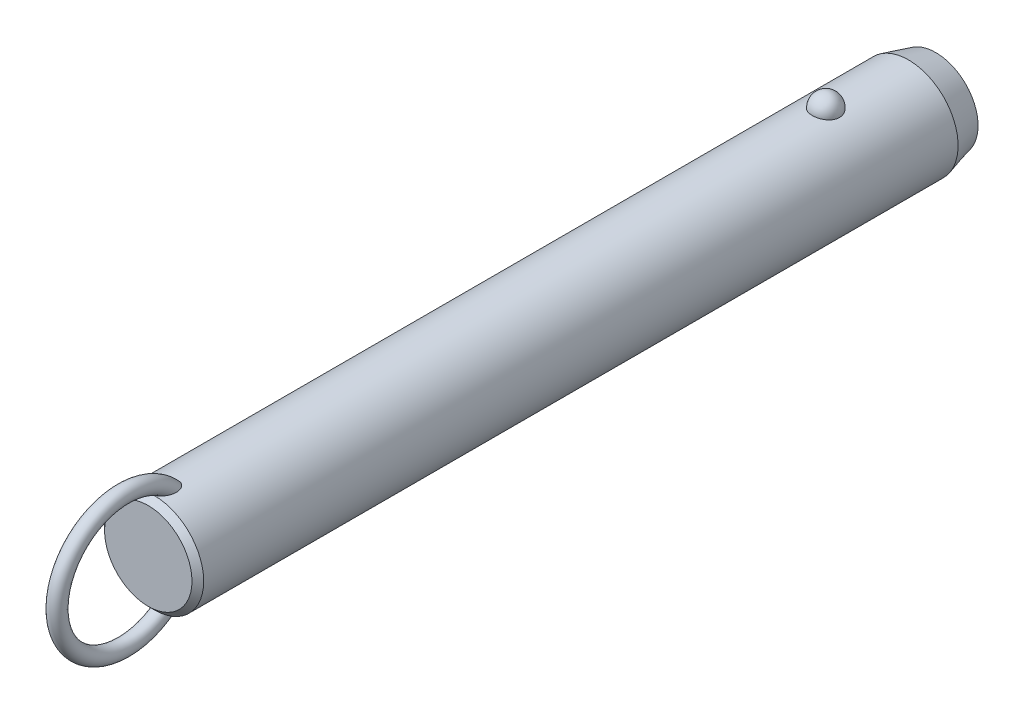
ISO-10303-21;
HEADER;
FILE_DESCRIPTION(('STEP AP214'),'2;1');
FILE_NAME('part.step','',(''),(''),'','','');
FILE_SCHEMA(('AUTOMOTIVE_DESIGN { 1 0 10303 214 1 1 1 1 }'));
ENDSEC;
DATA;
#1=APPLICATION_CONTEXT('core data for automotive mechanical design processes');
#2=APPLICATION_PROTOCOL_DEFINITION('international standard','automotive_design',2000,#1);
#3=PRODUCT_CONTEXT('',#1,'mechanical');
#4=PRODUCT('Part','Part','',(#3));
#5=PRODUCT_RELATED_PRODUCT_CATEGORY('part','',(#4));
#6=PRODUCT_DEFINITION_FORMATION('','',#4);
#7=PRODUCT_DEFINITION_CONTEXT('part definition',#1,'design');
#8=PRODUCT_DEFINITION('design','',#6,#7);
#9=PRODUCT_DEFINITION_SHAPE('','',#8);
#10=(LENGTH_UNIT() NAMED_UNIT(*) SI_UNIT(.MILLI.,.METRE.));
#11=(NAMED_UNIT(*) PLANE_ANGLE_UNIT() SI_UNIT($,.RADIAN.));
#12=(NAMED_UNIT(*) SI_UNIT($,.STERADIAN.) SOLID_ANGLE_UNIT());
#13=UNCERTAINTY_MEASURE_WITH_UNIT(LENGTH_MEASURE(1.E-05),#10,'distance_accuracy_value','');
#14=(GEOMETRIC_REPRESENTATION_CONTEXT(3) GLOBAL_UNCERTAINTY_ASSIGNED_CONTEXT((#13)) GLOBAL_UNIT_ASSIGNED_CONTEXT((#10,
#11,#12)) REPRESENTATION_CONTEXT('',''));
#15=CARTESIAN_POINT('',(0.,0.,0.));
#16=DIRECTION('',(0.,0.,1.));
#17=DIRECTION('',(1.,0.,0.));
#18=AXIS2_PLACEMENT_3D('',#15,#16,#17);
#19=CARTESIAN_POINT('',(0.,0.,157.5));
#20=DIRECTION('',(0.,0.,-1.));
#21=DIRECTION('',(-1.,0.,0.));
#22=AXIS2_PLACEMENT_3D('',#19,#20,#21);
#23=CYLINDRICAL_SURFACE('',#22,12.7);
#24=CARTESIAN_POINT('',(3.46661256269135,12.2177165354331,-3.50000000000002));
#25=CARTESIAN_POINT('',(3.4666090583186,12.2177194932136,-3.30432790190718));
#26=CARTESIAN_POINT('',(3.45063567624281,12.2222841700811,-3.10861112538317));
#27=CARTESIAN_POINT('',(3.38712451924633,12.2400345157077,-2.72271899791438));
#28=CARTESIAN_POINT('',(3.33957415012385,12.2532236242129,-2.53254588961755));
#29=CARTESIAN_POINT('',(3.2141234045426,12.286724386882,-2.16324948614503));
#30=CARTESIAN_POINT('',(3.13623639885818,12.3070329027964,-1.98412136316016));
#31=CARTESIAN_POINT('',(2.95205930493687,12.3525018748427,-1.6418059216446));
#32=CARTESIAN_POINT('',(2.84577003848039,12.3776621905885,-1.47861814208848));
#33=CARTESIAN_POINT('',(2.60688050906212,12.4301712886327,-1.17190583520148));
#34=CARTESIAN_POINT('',(2.47415697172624,12.4575299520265,-1.0284789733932));
#35=CARTESIAN_POINT('',(2.18615174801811,12.5112810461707,-0.766177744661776));
#36=CARTESIAN_POINT('',(2.03087002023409,12.5376734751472,-0.647303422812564));
#37=CARTESIAN_POINT('',(1.70237334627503,12.5864761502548,-0.437732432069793));
#38=CARTESIAN_POINT('',(1.52920948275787,12.6088972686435,-0.346958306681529));
#39=CARTESIAN_POINT('',(1.16944170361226,12.6473352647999,-0.195750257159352));
#40=CARTESIAN_POINT('',(0.982839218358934,12.663352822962,-0.135313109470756));
#41=CARTESIAN_POINT('',(0.604961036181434,12.6869706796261,-0.0473241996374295));
#42=CARTESIAN_POINT('',(0.41382314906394,12.6947125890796,-0.0192185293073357));
#43=CARTESIAN_POINT('',(0.0293827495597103,12.7014203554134,0.00517254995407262));
#44=CARTESIAN_POINT('',(-0.163919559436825,12.7003870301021,0.00146092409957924));
#45=CARTESIAN_POINT('',(-0.544374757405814,12.689735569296,-0.0373939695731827));
#46=CARTESIAN_POINT('',(-0.731575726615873,12.6802364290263,-0.0721015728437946));
#47=CARTESIAN_POINT('',(-1.09733277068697,12.6538333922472,-0.171364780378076));
#48=CARTESIAN_POINT('',(-1.27588869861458,12.6369293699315,-0.235920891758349));
#49=CARTESIAN_POINT('',(-1.6204698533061,12.5973946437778,-0.393548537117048));
#50=CARTESIAN_POINT('',(-1.78641865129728,12.5747321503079,-0.486778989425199));
#51=CARTESIAN_POINT('',(-2.10030671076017,12.5261316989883,-0.699110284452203));
#52=CARTESIAN_POINT('',(-2.24824419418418,12.5001934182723,-0.818213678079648));
#53=CARTESIAN_POINT('',(-2.52491489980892,12.4472906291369,-1.0815712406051));
#54=CARTESIAN_POINT('',(-2.65324222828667,12.4203160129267,-1.22624992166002));
#55=CARTESIAN_POINT('',(-2.88410007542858,12.3687509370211,-1.53528325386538));
#56=CARTESIAN_POINT('',(-2.98662883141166,12.3441606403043,-1.69963924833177));
#57=CARTESIAN_POINT('',(-3.16432417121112,12.2998199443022,-2.04548497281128));
#58=CARTESIAN_POINT('',(-3.23917525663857,12.2801261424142,-2.22714424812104));
#59=CARTESIAN_POINT('',(-3.35800573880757,12.248167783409,-2.60091389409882));
#60=CARTESIAN_POINT('',(-3.4019860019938,12.2359030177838,-2.79302397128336));
#61=CARTESIAN_POINT('',(-3.45784812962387,12.2202347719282,-3.18140279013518));
#62=CARTESIAN_POINT('',(-3.46986123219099,12.2167950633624,-3.37765118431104));
#63=CARTESIAN_POINT('',(-3.46186273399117,12.2190638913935,-3.76943689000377));
#64=CARTESIAN_POINT('',(-3.44185196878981,12.2247721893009,-3.96497421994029));
#65=CARTESIAN_POINT('',(-3.37048652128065,12.2446381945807,-4.34881728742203));
#66=CARTESIAN_POINT('',(-3.31928253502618,12.2587552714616,-4.53715319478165));
#67=CARTESIAN_POINT('',(-3.18693461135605,12.2938237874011,-4.9023172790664));
#68=CARTESIAN_POINT('',(-3.1057895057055,12.3147754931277,-5.07914500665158));
#69=CARTESIAN_POINT('',(-2.91506431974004,12.3613125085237,-5.41732059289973));
#70=CARTESIAN_POINT('',(-2.80533587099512,12.3869217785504,-5.57858147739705));
#71=CARTESIAN_POINT('',(-2.560414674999,12.4398525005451,-5.88013283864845));
#72=CARTESIAN_POINT('',(-2.42522099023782,12.4671740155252,-6.02042254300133));
#73=CARTESIAN_POINT('',(-2.1323357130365,12.5205965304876,-6.27662798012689));
#74=CARTESIAN_POINT('',(-1.97456596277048,12.5466928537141,-6.39245542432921));
#75=CARTESIAN_POINT('',(-1.64115839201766,12.5946384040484,-6.59583547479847));
#76=CARTESIAN_POINT('',(-1.46552179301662,12.6164879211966,-6.68339001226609));
#77=CARTESIAN_POINT('',(-1.10356050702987,12.6532533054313,-6.82682153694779));
#78=CARTESIAN_POINT('',(-0.9173913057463,12.6682500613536,-6.88306988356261));
#79=CARTESIAN_POINT('',(-0.537836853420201,12.6900288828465,-6.96386887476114));
#80=CARTESIAN_POINT('',(-0.344452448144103,12.6968119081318,-6.98842322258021));
#81=CARTESIAN_POINT('',(0.0402577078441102,12.7013667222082,-7.00496469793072));
#82=CARTESIAN_POINT('',(0.231556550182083,12.6993008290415,-6.99753844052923));
#83=CARTESIAN_POINT('',(0.610105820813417,12.6867505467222,-6.95166366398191));
#84=CARTESIAN_POINT('',(0.797356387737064,12.6762664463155,-6.91321620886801));
#85=CARTESIAN_POINT('',(1.16186657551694,12.6480587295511,-6.80658431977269));
#86=CARTESIAN_POINT('',(1.33915951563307,12.6303611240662,-6.73850666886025));
#87=CARTESIAN_POINT('',(1.67968518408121,12.5896027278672,-6.57450875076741));
#88=CARTESIAN_POINT('',(1.84291705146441,12.5665416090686,-6.47858678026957));
#89=CARTESIAN_POINT('',(2.15340192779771,12.5171072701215,-6.25982455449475));
#90=CARTESIAN_POINT('',(2.30037831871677,12.4906895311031,-6.13660186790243));
#91=CARTESIAN_POINT('',(2.5717412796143,12.4376567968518,-5.86739587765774));
#92=CARTESIAN_POINT('',(2.69612388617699,12.4110417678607,-5.72140858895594));
#93=CARTESIAN_POINT('',(2.92107785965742,12.360051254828,-5.40794137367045));
#94=CARTESIAN_POINT('',(3.02121329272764,12.3357209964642,-5.24014110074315));
#95=CARTESIAN_POINT('',(3.19236291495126,12.2925446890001,-4.88969865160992));
#96=CARTESIAN_POINT('',(3.26338839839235,12.2736965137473,-4.70706226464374));
#97=CARTESIAN_POINT('',(3.36788038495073,12.245404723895,-4.35469510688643));
#98=CARTESIAN_POINT('',(3.40484026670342,12.2351018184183,-4.18605935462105));
#99=CARTESIAN_POINT('',(3.45420764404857,12.2212564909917,-3.84496058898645));
#100=CARTESIAN_POINT('',(3.46661565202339,12.2177139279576,-3.67249765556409));
#101=CARTESIAN_POINT('',(3.46661256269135,12.2177165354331,-3.50000000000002));
#102=B_SPLINE_CURVE_WITH_KNOTS('',3,(#24,#25,#26,#27,#28,#29,#30,#31,#32,#33,#34,#35,#36,#37,
#38,#39,#40,#41,#42,#43,#44,#45,#46,#47,#48,#49,#50,#51,#52,#53,#54,#55,#56,#57,#58,#59,#60,#61,
#62,#63,#64,#65,#66,#67,#68,#69,#70,#71,#72,#73,#74,#75,#76,#77,#78,#79,#80,#81,#82,#83,#84,#85,
#86,#87,#88,#89,#90,#91,#92,#93,#94,#95,#96,#97,#98,#99,#100,#101),.UNSPECIFIED.,.T.,.F.,(4,2,2,
2,2,2,2,2,2,2,2,2,2,2,2,2,2,2,2,2,2,2,2,2,2,2,2,2,2,2,2,2,2,2,2,2,2,2,4),(0.,0.586396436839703,
1.17302689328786,1.7593990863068,2.34575431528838,2.93491084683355,3.52406845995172,
4.11158733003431,4.69904375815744,5.2762784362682,5.85345931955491,6.42265312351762,
6.99185659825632,7.56427334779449,8.136746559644,8.71981013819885,9.3029135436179,
9.89247258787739,10.4820150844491,11.0691335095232,11.6562366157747,12.2405256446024,
12.8248374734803,13.412244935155,13.9996740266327,14.5891883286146,15.1786623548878,
15.7609861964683,16.3432419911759,16.9148635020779,17.4864654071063,18.0560241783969,
18.6256177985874,19.2037609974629,19.7820055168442,20.3699810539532,20.957728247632,
21.4746855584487,21.9916320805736),.UNSPECIFIED.);
#103=CARTESIAN_POINT('',(3.46661256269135,12.2177165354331,-3.50000000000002));
#104=VERTEX_POINT('',#103);
#105=EDGE_CURVE('E41',#104,#104,#102,.T.);
#106=ORIENTED_EDGE('',*,*,#105,.T.);
#107=EDGE_LOOP('',(#106));
#108=FACE_BOUND('',#107,.T.);
#109=CARTESIAN_POINT('',(0.,0.,168.7));
#110=DIRECTION('',(0.,0.,1.));
#111=DIRECTION('',(1.,0.,0.));
#112=AXIS2_PLACEMENT_3D('',#109,#110,#111);
#113=CIRCLE('',#112,12.7);
#114=CARTESIAN_POINT('',(12.7,0.,168.7));
#115=VERTEX_POINT('',#114);
#116=EDGE_CURVE('E10',#115,#115,#113,.F.);
#117=ORIENTED_EDGE('',*,*,#116,.T.);
#118=EDGE_LOOP('',(#117));
#119=FACE_BOUND('',#118,.T.);
#120=CARTESIAN_POINT('',(-0.548122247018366,-12.6881662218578,162.443218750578));
#121=CARTESIAN_POINT('',(-0.648865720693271,-12.6838128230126,162.477926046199));
#122=CARTESIAN_POINT('',(-0.746398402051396,-12.6783867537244,162.522042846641));
#123=CARTESIAN_POINT('',(-0.932125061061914,-12.666091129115,162.626764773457));
#124=CARTESIAN_POINT('',(-1.02030388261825,-12.6592192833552,162.687396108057));
#125=CARTESIAN_POINT('',(-1.18487740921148,-12.6448747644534,162.821847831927));
#126=CARTESIAN_POINT('',(-1.26134296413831,-12.637406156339,162.895582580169));
#127=CARTESIAN_POINT('',(-1.4023120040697,-12.6225412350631,163.053604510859));
#128=CARTESIAN_POINT('',(-1.466814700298,-12.6151449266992,163.13789238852));
#129=CARTESIAN_POINT('',(-1.60714786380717,-12.5981718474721,163.349657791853));
#130=CARTESIAN_POINT('',(-1.67725126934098,-12.588900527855,163.480962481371));
#131=CARTESIAN_POINT('',(-1.79536591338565,-12.5725964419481,163.753247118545));
#132=CARTESIAN_POINT('',(-1.84333535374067,-12.5655679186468,163.894244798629));
#133=CARTESIAN_POINT('',(-1.93422576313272,-12.5519624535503,164.237645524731));
#134=CARTESIAN_POINT('',(-1.96788773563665,-12.5466298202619,164.442557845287));
#135=CARTESIAN_POINT('',(-1.9941399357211,-12.542463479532,164.751760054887));
#136=CARTESIAN_POINT('',(-1.99883864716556,-12.5417153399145,164.855298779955));
#137=CARTESIAN_POINT('',(-2.00078003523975,-12.5414074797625,165.06245124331));
#138=CARTESIAN_POINT('',(-1.99802449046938,-12.5418474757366,165.166064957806));
#139=CARTESIAN_POINT('',(-1.98336733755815,-12.5441750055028,165.41032076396));
#140=CARTESIAN_POINT('',(-1.96851430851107,-12.5465291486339,165.550780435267));
#141=CARTESIAN_POINT('',(-1.92707089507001,-12.5529612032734,165.829960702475));
#142=CARTESIAN_POINT('',(-1.900474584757,-12.5570399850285,165.968680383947));
#143=CARTESIAN_POINT('',(-1.83619120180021,-12.5666008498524,166.24341135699));
#144=CARTESIAN_POINT('',(-1.79850828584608,-12.57208240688,166.379423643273));
#145=CARTESIAN_POINT('',(-1.71223796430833,-12.5841228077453,166.647842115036));
#146=CARTESIAN_POINT('',(-1.66365679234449,-12.5906810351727,166.780250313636));
#147=CARTESIAN_POINT('',(-1.57804503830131,-12.6016176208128,166.98548877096));
#148=CARTESIAN_POINT('',(-1.54477252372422,-12.6057501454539,167.059914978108));
#149=CARTESIAN_POINT('',(-1.47424480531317,-12.6141930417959,167.206839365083));
#150=CARTESIAN_POINT('',(-1.43699041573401,-12.6185033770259,167.279337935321));
#151=CARTESIAN_POINT('',(-1.35825795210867,-12.6272207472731,167.421892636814));
#152=CARTESIAN_POINT('',(-1.31678520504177,-12.6316276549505,167.491951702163));
#153=CARTESIAN_POINT('',(-1.22917793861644,-12.6404532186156,167.629070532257));
#154=CARTESIAN_POINT('',(-1.18304514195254,-12.6448718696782,167.696131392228));
#155=CARTESIAN_POINT('',(-1.07246411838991,-12.6547893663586,167.843874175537));
#156=CARTESIAN_POINT('',(-1.0064223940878,-12.6602600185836,167.923384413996));
#157=CARTESIAN_POINT('',(-0.864441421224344,-12.6707460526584,168.073169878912));
#158=CARTESIAN_POINT('',(-0.788516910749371,-12.6757620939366,168.143458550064));
#159=CARTESIAN_POINT('',(-0.652215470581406,-12.6833591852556,168.248680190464));
#160=CARTESIAN_POINT('',(-0.594982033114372,-12.6861973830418,168.287624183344));
#161=CARTESIAN_POINT('',(-0.475269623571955,-12.6912445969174,168.356489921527));
#162=CARTESIAN_POINT('',(-0.412800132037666,-12.6934547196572,168.386427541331));
#163=CARTESIAN_POINT('',(-0.295749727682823,-12.6966636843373,168.42975652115));
#164=CARTESIAN_POINT('',(-0.241949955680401,-12.6978134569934,168.445218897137));
#165=CARTESIAN_POINT('',(-0.132508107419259,-12.6994261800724,168.466884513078));
#166=CARTESIAN_POINT('',(-0.0768679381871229,-12.6998898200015,168.473097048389));
#167=CARTESIAN_POINT('',(0.0347696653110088,-12.7000752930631,168.475583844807));
#168=CARTESIAN_POINT('',(0.0907676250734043,-12.6997954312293,168.471835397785));
#169=CARTESIAN_POINT('',(0.201283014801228,-12.6985255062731,168.454788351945));
#170=CARTESIAN_POINT('',(0.255799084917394,-12.6975348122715,168.441481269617));
#171=CARTESIAN_POINT('',(0.376042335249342,-12.6946091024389,168.40203792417));
#172=CARTESIAN_POINT('',(0.440950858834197,-12.6924943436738,168.373449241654));
#173=CARTESIAN_POINT('',(0.56535027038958,-12.6875639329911,168.306323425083));
#174=CARTESIAN_POINT('',(0.624828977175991,-12.6847467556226,168.267764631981));
#175=CARTESIAN_POINT('',(0.774116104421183,-12.6767252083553,168.156949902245));
#176=CARTESIAN_POINT('',(0.859449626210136,-12.6711344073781,168.078760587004));
#177=CARTESIAN_POINT('',(1.01789440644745,-12.6593922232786,167.910943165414));
#178=CARTESIAN_POINT('',(1.09096902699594,-12.653239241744,167.821282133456));
#179=CARTESIAN_POINT('',(1.22268793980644,-12.6411674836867,167.640265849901));
#180=CARTESIAN_POINT('',(1.28193986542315,-12.6352572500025,167.549345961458));
#181=CARTESIAN_POINT('',(1.39259777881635,-12.6235401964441,167.362792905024));
#182=CARTESIAN_POINT('',(1.44399707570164,-12.6177334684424,167.267155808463));
#183=CARTESIAN_POINT('',(1.53972870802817,-12.6064093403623,167.072273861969));
#184=CARTESIAN_POINT('',(1.58405262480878,-12.6008922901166,166.973024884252));
#185=CARTESIAN_POINT('',(1.66600705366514,-12.5903187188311,166.771772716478));
#186=CARTESIAN_POINT('',(1.70363651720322,-12.5852622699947,166.669769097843));
#187=CARTESIAN_POINT('',(1.77545379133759,-12.5753406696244,166.454358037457));
#188=CARTESIAN_POINT('',(1.80903453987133,-12.5705328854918,166.340745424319));
#189=CARTESIAN_POINT('',(1.86844163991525,-12.5618400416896,166.111457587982));
#190=CARTESIAN_POINT('',(1.89426665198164,-12.5579551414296,165.995782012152));
#191=CARTESIAN_POINT('',(1.93785464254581,-12.5513030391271,165.763007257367));
#192=CARTESIAN_POINT('',(1.95562640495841,-12.5485346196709,165.645909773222));
#193=CARTESIAN_POINT('',(1.98264463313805,-12.5442934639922,165.410747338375));
#194=CARTESIAN_POINT('',(1.99189298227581,-12.5428204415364,165.29268260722));
#195=CARTESIAN_POINT('',(2.00416068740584,-12.540871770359,164.980622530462));
#196=CARTESIAN_POINT('',(1.99944433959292,-12.541631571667,164.786229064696));
#197=CARTESIAN_POINT('',(1.96113755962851,-12.5476846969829,164.400309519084));
#198=CARTESIAN_POINT('',(1.92758341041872,-12.5529723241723,164.208780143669));
#199=CARTESIAN_POINT('',(1.83934342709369,-12.5661532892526,163.882272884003));
#200=CARTESIAN_POINT('',(1.79215440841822,-12.5730485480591,163.74524997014));
#201=CARTESIAN_POINT('',(1.67676242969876,-12.588958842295,163.480445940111));
#202=CARTESIAN_POINT('',(1.60859050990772,-12.597970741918,163.352651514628));
#203=CARTESIAN_POINT('',(1.4658383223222,-12.6152829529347,163.135800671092));
#204=CARTESIAN_POINT('',(1.39525727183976,-12.6233659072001,163.04410500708));
#205=CARTESIAN_POINT('',(1.23992594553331,-12.6395676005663,162.873485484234));
#206=CARTESIAN_POINT('',(1.1551793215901,-12.6476863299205,162.794558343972));
#207=CARTESIAN_POINT('',(0.971995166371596,-12.6630846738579,162.652643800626));
#208=CARTESIAN_POINT('',(0.873456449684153,-12.6703572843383,162.589784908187));
#209=CARTESIAN_POINT('',(0.665847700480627,-12.6829569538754,162.484487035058));
#210=CARTESIAN_POINT('',(0.556784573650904,-12.688285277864,162.442034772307));
#211=CARTESIAN_POINT('',(0.347338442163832,-12.6956226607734,162.384443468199));
#212=CARTESIAN_POINT('',(0.24775974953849,-12.6979816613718,162.366399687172));
#213=CARTESIAN_POINT('',(0.0470218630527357,-12.7003077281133,162.348600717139));
#214=CARTESIAN_POINT('',(-0.0541350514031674,-12.7002779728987,162.348821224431));
#215=CARTESIAN_POINT('',(-0.221414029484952,-12.6982482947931,162.364363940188));
#216=CARTESIAN_POINT('',(-0.288055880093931,-12.6969033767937,162.374666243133));
#217=CARTESIAN_POINT('',(-0.419599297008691,-12.6932369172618,162.40313489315));
#218=CARTESIAN_POINT('',(-0.484501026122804,-12.6909154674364,162.421300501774));
#219=CARTESIAN_POINT('',(-0.548122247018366,-12.6881662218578,162.443218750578));
#220=B_SPLINE_CURVE_WITH_KNOTS('',3,(#120,#121,#122,#123,#124,#125,#126,#127,#128,#129,#130,
#131,#132,#133,#134,#135,#136,#137,#138,#139,#140,#141,#142,#143,#144,#145,#146,#147,#148,#149,
#150,#151,#152,#153,#154,#155,#156,#157,#158,#159,#160,#161,#162,#163,#164,#165,#166,#167,#168,
#169,#170,#171,#172,#173,#174,#175,#176,#177,#178,#179,#180,#181,#182,#183,#184,#185,#186,#187,
#188,#189,#190,#191,#192,#193,#194,#195,#196,#197,#198,#199,#200,#201,#202,#203,#204,#205,#206,
#207,#208,#209,#210,#211,#212,#213,#214,#215,#216,#217,#218,#219),.UNSPECIFIED.,.T.,.F.,(4,2,2,
2,2,2,2,2,2,2,2,2,2,2,2,2,2,2,2,2,2,2,2,2,2,2,2,2,2,2,2,2,2,2,2,2,2,2,2,2,2,2,2,2,2,2,2,2,2,4),
(0.,0.31964225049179,0.639794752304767,0.957927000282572,1.27608021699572,1.72100165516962,
2.16675988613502,2.78630021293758,3.09705782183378,3.40774128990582,3.8309635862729,
4.25439969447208,4.67767724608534,5.1007133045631,5.34550297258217,5.59024267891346,
5.83467707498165,6.07902143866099,6.38891080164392,6.69834321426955,6.90560910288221,
7.11250749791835,7.27977315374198,7.44687060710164,7.61434932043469,7.78197685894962,
7.99365544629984,8.20579780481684,8.55147335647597,8.89816429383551,9.22375138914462,
9.54961437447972,9.87586224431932,10.202161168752,10.557587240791,10.9130746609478,
11.2681734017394,11.6231936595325,12.2046601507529,12.7853961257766,13.219164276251,
13.6522938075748,13.9989174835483,14.3454519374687,14.6946768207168,15.0436740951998,
15.3457513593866,15.6474266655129,15.8493051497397,16.0511646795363),.UNSPECIFIED.);
#221=CARTESIAN_POINT('',(-0.548122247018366,-12.6881662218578,162.443218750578));
#222=VERTEX_POINT('',#221);
#223=EDGE_CURVE('E59',#222,#222,#220,.T.);
#224=ORIENTED_EDGE('',*,*,#223,.T.);
#225=EDGE_LOOP('',(#224));
#226=FACE_BOUND('',#225,.T.);
#227=CARTESIAN_POINT('',(-0.548122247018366,12.6881662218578,162.443218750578));
#228=CARTESIAN_POINT('',(-0.459436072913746,12.6919968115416,162.412673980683));
#229=CARTESIAN_POINT('',(-0.368189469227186,12.6949996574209,162.389391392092));
#230=CARTESIAN_POINT('',(-0.183024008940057,12.6990186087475,162.358406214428));
#231=CARTESIAN_POINT('',(-0.0891049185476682,12.7000345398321,162.350704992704));
#232=CARTESIAN_POINT('',(0.0987147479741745,12.6999636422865,162.351245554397));
#233=CARTESIAN_POINT('',(0.192615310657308,12.6988761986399,162.359492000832));
#234=CARTESIAN_POINT('',(0.377658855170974,12.6947211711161,162.391551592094));
#235=CARTESIAN_POINT('',(0.468801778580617,12.6916535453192,162.415365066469));
#236=CARTESIAN_POINT('',(0.645809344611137,12.6838788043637,162.47745651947));
#237=CARTESIAN_POINT('',(0.731679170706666,12.6791733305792,162.515720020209));
#238=CARTESIAN_POINT('',(0.896315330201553,12.6686004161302,162.605120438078));
#239=CARTESIAN_POINT('',(0.97508059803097,12.6627328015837,162.656259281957));
#240=CARTESIAN_POINT('',(1.12963655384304,12.6499161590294,162.77367820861));
#241=CARTESIAN_POINT('',(1.20478673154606,12.6429194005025,162.840792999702));
#242=CARTESIAN_POINT('',(1.34448241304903,12.6288282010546,162.98522507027));
#243=CARTESIAN_POINT('',(1.40902173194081,12.621733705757,163.062548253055));
#244=CARTESIAN_POINT('',(1.55208211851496,12.6050877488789,163.259247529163));
#245=CARTESIAN_POINT('',(1.62510490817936,12.5957546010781,163.382654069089));
#246=CARTESIAN_POINT('',(1.75019044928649,12.5789823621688,163.639769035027));
#247=CARTESIAN_POINT('',(1.8022137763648,12.5715468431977,163.773496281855));
#248=CARTESIAN_POINT('',(1.90309965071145,12.5567434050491,164.098351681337));
#249=CARTESIAN_POINT('',(1.94342317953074,12.5504515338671,164.292161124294));
#250=CARTESIAN_POINT('',(1.99332997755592,12.5426147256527,164.68378810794));
#251=CARTESIAN_POINT('',(2.00285305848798,12.5410790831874,164.881612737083));
#252=CARTESIAN_POINT('',(1.99678999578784,12.5420407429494,165.216642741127));
#253=CARTESIAN_POINT('',(1.98794117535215,12.5434564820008,165.354042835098));
#254=CARTESIAN_POINT('',(1.95865119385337,12.5480641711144,165.627639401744));
#255=CARTESIAN_POINT('',(1.93820436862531,12.5512569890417,165.763835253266));
#256=CARTESIAN_POINT('',(1.88647896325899,12.5591352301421,166.034249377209));
#257=CARTESIAN_POINT('',(1.85518800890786,12.5638223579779,166.168465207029));
#258=CARTESIAN_POINT('',(1.78217886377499,12.5743868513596,166.433936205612));
#259=CARTESIAN_POINT('',(1.74046509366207,12.5802637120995,166.565192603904));
#260=CARTESIAN_POINT('',(1.66024095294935,12.5910571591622,166.786085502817));
#261=CARTESIAN_POINT('',(1.62434772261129,12.5957535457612,166.876690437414));
#262=CARTESIAN_POINT('',(1.54709009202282,12.6054762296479,167.055512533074));
#263=CARTESIAN_POINT('',(1.50572681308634,12.6105024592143,167.143730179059));
#264=CARTESIAN_POINT('',(1.41728020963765,12.620748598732,167.316932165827));
#265=CARTESIAN_POINT('',(1.37021377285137,12.625967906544,167.401925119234));
#266=CARTESIAN_POINT('',(1.26969620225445,12.6364721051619,167.568007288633));
#267=CARTESIAN_POINT('',(1.21624929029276,12.6417569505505,167.649099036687));
#268=CARTESIAN_POINT('',(1.1030441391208,12.6521331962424,167.804702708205));
#269=CARTESIAN_POINT('',(1.04340936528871,12.657226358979,167.879303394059));
#270=CARTESIAN_POINT('',(0.915919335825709,12.667090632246,168.021324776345));
#271=CARTESIAN_POINT('',(0.848064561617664,12.6718617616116,168.08874589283));
#272=CARTESIAN_POINT('',(0.717035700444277,12.67987711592,168.200624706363));
#273=CARTESIAN_POINT('',(0.655526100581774,12.6832377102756,168.246997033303));
#274=CARTESIAN_POINT('',(0.525985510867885,12.6892676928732,168.329619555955));
#275=CARTESIAN_POINT('',(0.457969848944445,12.6919386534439,168.365892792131));
#276=CARTESIAN_POINT('',(0.334859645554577,12.695691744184,168.416657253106));
#277=CARTESIAN_POINT('',(0.281116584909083,12.6970073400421,168.434373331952));
#278=CARTESIAN_POINT('',(0.171425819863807,12.6989609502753,168.460642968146));
#279=CARTESIAN_POINT('',(0.115480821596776,12.699599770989,168.469207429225));
#280=CARTESIAN_POINT('',(0.00272618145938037,12.7001251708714,168.476253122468));
#281=CARTESIAN_POINT('',(-0.0540859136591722,12.7000089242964,168.474696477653));
#282=CARTESIAN_POINT('',(-0.16654462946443,12.6990328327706,168.461600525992));
#283=CARTESIAN_POINT('',(-0.222190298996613,12.6981724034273,168.450053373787));
#284=CARTESIAN_POINT('',(-0.342018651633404,12.695562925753,168.414912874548));
#285=CARTESIAN_POINT('',(-0.405606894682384,12.6936676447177,168.38933225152));
#286=CARTESIAN_POINT('',(-0.527815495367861,12.6891754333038,168.328311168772));
#287=CARTESIAN_POINT('',(-0.586425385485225,12.6865770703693,168.292850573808));
#288=CARTESIAN_POINT('',(-0.731842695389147,12.6792129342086,168.191496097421));
#289=CARTESIAN_POINT('',(-0.814709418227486,12.6740767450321,168.1200395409));
#290=CARTESIAN_POINT('',(-0.969101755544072,12.6632083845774,167.96589007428));
#291=CARTESIAN_POINT('',(-1.04059564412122,12.6574746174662,167.883166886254));
#292=CARTESIAN_POINT('',(-1.16981116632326,12.6461638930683,167.715809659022));
#293=CARTESIAN_POINT('',(-1.22811369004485,12.6405994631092,167.631616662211));
#294=CARTESIAN_POINT('',(-1.33743405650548,12.6295007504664,167.458579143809));
#295=CARTESIAN_POINT('',(-1.38844577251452,12.6239664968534,167.369730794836));
#296=CARTESIAN_POINT('',(-1.48400702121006,12.6130898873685,167.188389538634));
#297=CARTESIAN_POINT('',(-1.52854232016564,12.6077479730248,167.095889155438));
#298=CARTESIAN_POINT('',(-1.61150113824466,12.5974127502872,166.908160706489));
#299=CARTESIAN_POINT('',(-1.64992317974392,12.5924195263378,166.812931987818));
#300=CARTESIAN_POINT('',(-1.73468589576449,12.581070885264,166.58289362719));
#301=CARTESIAN_POINT('',(-1.77831261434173,12.5749388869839,166.447066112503));
#302=CARTESIAN_POINT('',(-1.85439734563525,12.5639437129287,166.172212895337));
#303=CARTESIAN_POINT('',(-1.88684994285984,12.5590811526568,166.033185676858));
#304=CARTESIAN_POINT('',(-1.94008483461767,12.550968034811,165.75309235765));
#305=CARTESIAN_POINT('',(-1.96088706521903,12.5477147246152,165.612030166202));
#306=CARTESIAN_POINT('',(-1.99000539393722,12.5431291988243,165.328668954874));
#307=CARTESIAN_POINT('',(-1.99832911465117,12.5417958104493,165.186370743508));
#308=CARTESIAN_POINT('',(-2.00166624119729,12.5412674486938,164.857627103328));
#309=CARTESIAN_POINT('',(-1.99178843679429,12.5428579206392,164.671088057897));
#310=CARTESIAN_POINT('',(-1.94455183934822,12.5502731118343,164.30162404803));
#311=CARTESIAN_POINT('',(-1.90724032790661,12.5560905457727,164.118693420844));
#312=CARTESIAN_POINT('',(-1.81330718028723,12.5699462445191,163.804848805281));
#313=CARTESIAN_POINT('',(-1.76338820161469,12.5771273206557,163.671910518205));
#314=CARTESIAN_POINT('',(-1.64305018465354,12.593414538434,163.415681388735));
#315=CARTESIAN_POINT('',(-1.57265346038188,12.6025185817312,163.292380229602));
#316=CARTESIAN_POINT('',(-1.42634956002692,12.6198178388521,163.083564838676));
#317=CARTESIAN_POINT('',(-1.35423772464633,12.6278405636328,162.995384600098));
#318=CARTESIAN_POINT('',(-1.19645664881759,12.6437632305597,162.832107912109));
#319=CARTESIAN_POINT('',(-1.11080536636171,12.6516633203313,162.756994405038));
#320=CARTESIAN_POINT('',(-0.947219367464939,12.6648319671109,162.637811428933));
#321=CARTESIAN_POINT('',(-0.871624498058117,12.670300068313,162.590541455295));
#322=CARTESIAN_POINT('',(-0.714161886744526,12.6801492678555,162.5077413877));
#323=CARTESIAN_POINT('',(-0.632295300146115,12.684530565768,162.47220913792));
#324=CARTESIAN_POINT('',(-0.548122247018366,12.6881662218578,162.443218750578));
#325=B_SPLINE_CURVE_WITH_KNOTS('',3,(#227,#228,#229,#230,#231,#232,#233,#234,#235,#236,#237,
#238,#239,#240,#241,#242,#243,#244,#245,#246,#247,#248,#249,#250,#251,#252,#253,#254,#255,#256,
#257,#258,#259,#260,#261,#262,#263,#264,#265,#266,#267,#268,#269,#270,#271,#272,#273,#274,#275,
#276,#277,#278,#279,#280,#281,#282,#283,#284,#285,#286,#287,#288,#289,#290,#291,#292,#293,#294,
#295,#296,#297,#298,#299,#300,#301,#302,#303,#304,#305,#306,#307,#308,#309,#310,#311,#312,#313,
#314,#315,#316,#317,#318,#319,#320,#321,#322,#323,#324),.UNSPECIFIED.,.T.,.F.,(4,2,2,2,2,2,2,2,
2,2,2,2,2,2,2,2,2,2,2,2,2,2,2,2,2,2,2,2,2,2,2,2,2,2,2,2,2,2,2,2,2,2,2,2,2,2,2,2,4),(0.,
0.281328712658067,0.562682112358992,0.844117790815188,1.12555942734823,1.40671982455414,
1.68792232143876,1.98972294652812,2.29169886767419,2.72039860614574,3.14989948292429,
3.74084916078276,4.33295293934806,4.74554109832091,5.15833092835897,5.57159335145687,
5.98468079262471,6.27722775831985,6.56971484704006,6.86135609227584,7.15280542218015,
7.43927407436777,7.72572595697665,7.95635862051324,8.18646071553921,8.35559393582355,
8.52452541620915,8.69408946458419,8.86378678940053,9.06834348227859,9.27332014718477,
9.6001041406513,9.92778432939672,10.2350252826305,10.5425229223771,10.8506864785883,
11.15892440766,11.5867893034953,12.0148612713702,12.4421984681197,12.8692745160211,
13.4279365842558,13.9856380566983,14.4107062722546,14.835313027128,15.1765567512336,
15.517351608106,15.7844129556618,16.051425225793),.UNSPECIFIED.);
#326=CARTESIAN_POINT('',(-0.548122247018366,12.6881662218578,162.443218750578));
#327=VERTEX_POINT('',#326);
#328=EDGE_CURVE('E67',#327,#327,#325,.T.);
#329=ORIENTED_EDGE('',*,*,#328,.T.);
#330=EDGE_LOOP('',(#329));
#331=FACE_BOUND('',#330,.T.);
#332=CARTESIAN_POINT('',(0.,0.,-24.6999999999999));
#333=DIRECTION('',(0.,0.,-1.));
#334=DIRECTION('',(-1.,0.,0.));
#335=AXIS2_PLACEMENT_3D('',#332,#333,#334);
#336=CIRCLE('',#335,12.7);
#337=CARTESIAN_POINT('',(-12.7,0.,-24.6999999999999));
#338=VERTEX_POINT('',#337);
#339=EDGE_CURVE('E56',#338,#338,#336,.F.);
#340=ORIENTED_EDGE('',*,*,#339,.T.);
#341=EDGE_LOOP('',(#340));
#342=FACE_BOUND('',#341,.T.);
#343=ADVANCED_FACE('F37',(#108,#119,#226,#331,#342),#23,.T.);
#344=CARTESIAN_POINT('',(0.,0.,-31.7));
#345=DIRECTION('',(0.,0.,-1.));
#346=DIRECTION('',(-1.,0.,0.));
#347=AXIS2_PLACEMENT_3D('',#344,#345,#346);
#348=PLANE('',#347);
#349=CARTESIAN_POINT('',(0.,0.,-31.7));
#350=DIRECTION('',(0.,0.,-1.));
#351=DIRECTION('',(-1.,0.,0.));
#352=AXIS2_PLACEMENT_3D('',#349,#350,#351);
#353=CIRCLE('',#352,10.8243556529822);
#354=CARTESIAN_POINT('',(-10.8243556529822,0.,-31.7));
#355=VERTEX_POINT('',#354);
#356=EDGE_CURVE('E66',#355,#355,#353,.T.);
#357=ORIENTED_EDGE('',*,*,#356,.T.);
#358=EDGE_LOOP('',(#357));
#359=FACE_BOUND('',#358,.T.);
#360=ADVANCED_FACE('F85',(#359),#348,.T.);
#361=CARTESIAN_POINT('',(0.,0.,-31.7));
#362=DIRECTION('',(0.,0.,1.));
#363=DIRECTION('',(1.,0.,0.));
#364=AXIS2_PLACEMENT_3D('',#361,#362,#363);
#365=CONICAL_SURFACE('',#364,10.8243556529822,0.261799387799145);
#366=ORIENTED_EDGE('',*,*,#339,.F.);
#367=EDGE_LOOP('',(#366));
#368=FACE_BOUND('',#367,.T.);
#369=ORIENTED_EDGE('',*,*,#356,.F.);
#370=EDGE_LOOP('',(#369));
#371=FACE_BOUND('',#370,.T.);
#372=ADVANCED_FACE('F83',(#368,#371),#365,.T.);
#373=CARTESIAN_POINT('',(0.,0.,170.2));
#374=DIRECTION('',(0.,0.,1.));
#375=DIRECTION('',(1.,0.,0.));
#376=AXIS2_PLACEMENT_3D('',#373,#374,#375);
#377=PLANE('',#376);
#378=CARTESIAN_POINT('',(0.,0.,170.2));
#379=DIRECTION('',(0.,0.,1.));
#380=DIRECTION('',(1.,0.,0.));
#381=AXIS2_PLACEMENT_3D('',#378,#379,#380);
#382=CIRCLE('',#381,11.2);
#383=CARTESIAN_POINT('',(11.2,0.,170.2));
#384=VERTEX_POINT('',#383);
#385=EDGE_CURVE('E50',#384,#384,#382,.T.);
#386=ORIENTED_EDGE('',*,*,#385,.T.);
#387=EDGE_LOOP('',(#386));
#388=FACE_BOUND('',#387,.T.);
#389=ADVANCED_FACE('F77',(#388),#377,.T.);
#390=CARTESIAN_POINT('',(0.,0.,176.55));
#391=DIRECTION('',(1.,0.,0.));
#392=DIRECTION('',(0.,0.,-1.));
#393=AXIS2_PLACEMENT_3D('',#390,#391,#392);
#394=TOROIDAL_SURFACE('',#393,17.05,2.);
#395=ORIENTED_EDGE('',*,*,#328,.F.);
#396=EDGE_LOOP('',(#395));
#397=FACE_BOUND('',#396,.T.);
#398=ORIENTED_EDGE('',*,*,#223,.F.);
#399=EDGE_LOOP('',(#398));
#400=FACE_BOUND('',#399,.T.);
#401=ADVANCED_FACE('F73',(#397,#400),#394,.T.);
#402=CARTESIAN_POINT('',(0.,0.,170.2));
#403=DIRECTION('',(0.,0.,-1.));
#404=DIRECTION('',(-1.,0.,0.));
#405=AXIS2_PLACEMENT_3D('',#402,#403,#404);
#406=CONICAL_SURFACE('',#405,11.2,0.785398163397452);
#407=ORIENTED_EDGE('',*,*,#116,.F.);
#408=EDGE_LOOP('',(#407));
#409=FACE_BOUND('',#408,.T.);
#410=ORIENTED_EDGE('',*,*,#385,.F.);
#411=EDGE_LOOP('',(#410));
#412=FACE_BOUND('',#411,.T.);
#413=ADVANCED_FACE('F39',(#409,#412),#406,.T.);
#414=CARTESIAN_POINT('',(0.,12.7,-3.50000000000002));
#415=DIRECTION('',(0.,1.,0.));
#416=DIRECTION('',(0.,0.,-1.));
#417=AXIS2_PLACEMENT_3D('',#414,#415,#416);
#418=SPHERICAL_SURFACE('',#417,3.5);
#419=ORIENTED_EDGE('',*,*,#105,.F.);
#420=EDGE_LOOP('',(#419));
#421=FACE_BOUND('',#420,.T.);
#422=ADVANCED_FACE('F79',(#421),#418,.T.);
#423=CLOSED_SHELL('',(#343,#360,#372,#389,#401,#413,#422));
#424=MANIFOLD_SOLID_BREP('B2',#423);
#425=ADVANCED_BREP_SHAPE_REPRESENTATION('',(#18,#424),#14);
#426=SHAPE_DEFINITION_REPRESENTATION(#9,#425);
ENDSEC;
END-ISO-10303-21;
